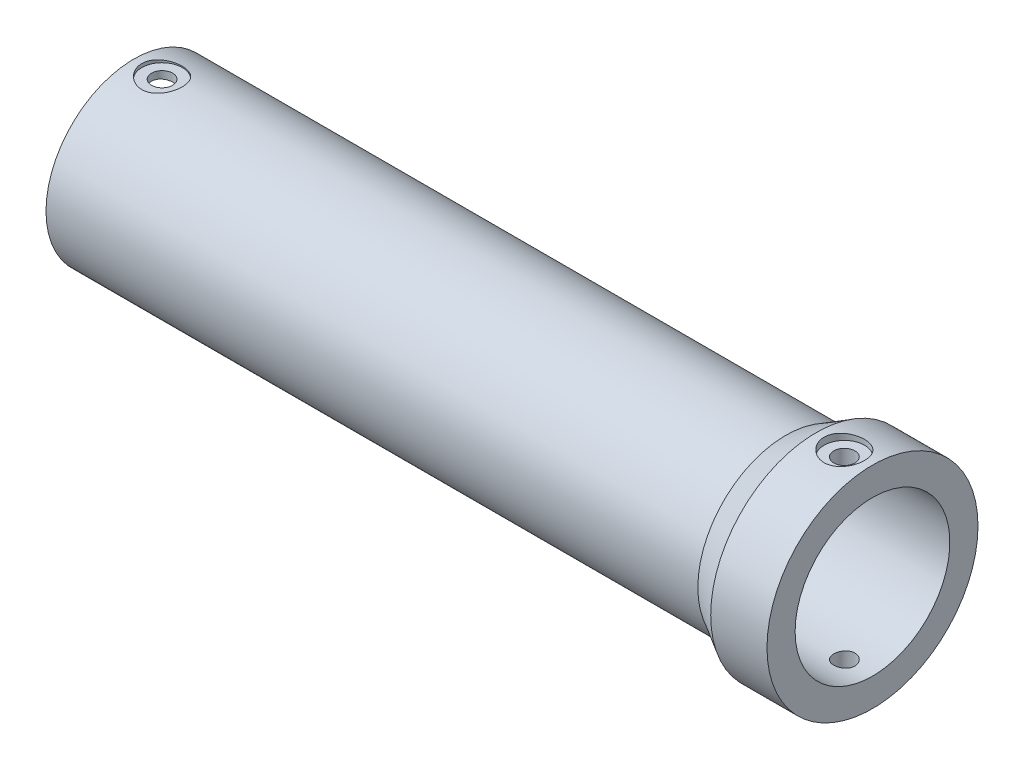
from build123d import *

# Parameters (mm, degrees)
SKETCH2_R          = 1.5
CUT_EXTRUDE1_DEPTH = 12
SKETCH4_R          = 2.875
CUT_EXTRUDE3_DEPTH = 1
CIRPATTERN1_COUNT  = 2
SKETCH7_R          = 1.5
CUT_EXTRUDE6_DEPTH = 10
CIRPATTERN3_COUNT  = 2
SKETCH8_R          = 2.875
CUT_EXTRUDE7_DEPTH = 0.5
CIRPATTERN4_COUNT  = 2
SKETCH9_R          = 1.35
CUT_EXTRUDE8_DEPTH = 10
CIRPATTERN5_COUNT  = 3


with BuildPart() as part:
    # Sketch1 → Base-Revolve (revolve)
    with BuildSketch(Plane.XY, mode=Mode.PRIVATE) as base_revolve_sk:
        Polygon((0, 11), (48, 11), (48, 4.5), (50, 4.5), (50, 11), (105, 11), (105, 15), (97, 15), (92.669872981, 12.5), (0, 12.5), align=None)
    revolve(base_revolve_sk.sketch.rotate(Axis((0, 0, 0), (1, 0, 0)), 90), axis=Axis((0, 0, 0), (1, 0, 0)))

    # Sketch2 → Cut-Extrude1 (cut)
    with BuildSketch(Plane(origin=(0, 15, 0), x_dir=(-1, 0, 0), z_dir=(0, 1, 0))):
        with Locations(Location((-101, 0, 0), (0, 0, 90))):
            Circle(SKETCH2_R)
    cut_extrude1 = extrude(amount=-CUT_EXTRUDE1_DEPTH, mode=Mode.SUBTRACT)

    # Sketch4 → Cut-Extrude3 (cut)
    with BuildSketch(Plane(origin=(0, 15, 0), x_dir=(-1, 0, 0), z_dir=(0, 1, 0))):
        with Locations(Location((-101, 0, 0), (0, 0, 90))):
            Circle(SKETCH4_R)
    cut_extrude3 = extrude(amount=-CUT_EXTRUDE3_DEPTH, mode=Mode.SUBTRACT)

    # CirPattern1: Cut-Extrude1, Cut-Extrude3 ×2 about axis
    cirpattern1_axis = Axis((0, 0, 0), (1, 0, 0))
    add([cut_extrude1.rotate(cirpattern1_axis, i * 360 / CIRPATTERN1_COUNT) for i in range(1, CIRPATTERN1_COUNT)], mode=Mode.SUBTRACT)
    add([cut_extrude3.rotate(cirpattern1_axis, i * 360 / CIRPATTERN1_COUNT) for i in range(1, CIRPATTERN1_COUNT)], mode=Mode.SUBTRACT)

    # Sketch7 → Cut-Extrude6 (cut)
    with BuildSketch(Plane(origin=(0, 15, 0), x_dir=(-1, 0, 0), z_dir=(0, 1, 0))):
        with Locations(Location((-4, 0, 0), (0, 0, 90))):
            Circle(SKETCH7_R)
    cut_extrude6 = extrude(amount=-CUT_EXTRUDE6_DEPTH, mode=Mode.SUBTRACT)

    # CirPattern3: Cut-Extrude6 ×2 about axis
    cirpattern3_axis = Axis((0, 0, 0), (1, 0, 0))
    for i in range(1, CIRPATTERN3_COUNT):
        add(cut_extrude6.rotate(cirpattern3_axis, i * 360 / CIRPATTERN3_COUNT), mode=Mode.SUBTRACT)

    # Sketch8 → Cut-Extrude7 (cut)
    with BuildSketch(Plane(origin=(0, 12.5, 0), x_dir=(-1, 0, 0), z_dir=(0, 1, 0))):
        with Locations(Location((-4, 0, 0), (0, 0, 90))):
            Circle(SKETCH8_R)
    cut_extrude7 = extrude(amount=-CUT_EXTRUDE7_DEPTH, mode=Mode.SUBTRACT)

    # CirPattern4: Cut-Extrude7 ×2 about axis
    cirpattern4_axis = Axis((0, 0, 0), (1, 0, 0))
    for i in range(1, CIRPATTERN4_COUNT):
        add(cut_extrude7.rotate(cirpattern4_axis, i * 360 / CIRPATTERN4_COUNT), mode=Mode.SUBTRACT)

    # Sketch9 → Cut-Extrude8 (cut)
    with BuildSketch(Plane(origin=(50, 0, 0), x_dir=(0, 0, -1), z_dir=(1, 0, 0))):
        with Locations((0, 7)):
            Circle(SKETCH9_R)
    cut_extrude8 = extrude(amount=-CUT_EXTRUDE8_DEPTH, mode=Mode.SUBTRACT)

    # CirPattern5: Cut-Extrude8 ×3 about axis
    cirpattern5_axis = Axis((0, 0, 0), (1, 0, 0))
    for i in range(1, CIRPATTERN5_COUNT):
        add(cut_extrude8.rotate(cirpattern5_axis, i * 360 / CIRPATTERN5_COUNT), mode=Mode.SUBTRACT)


solid = part.part
